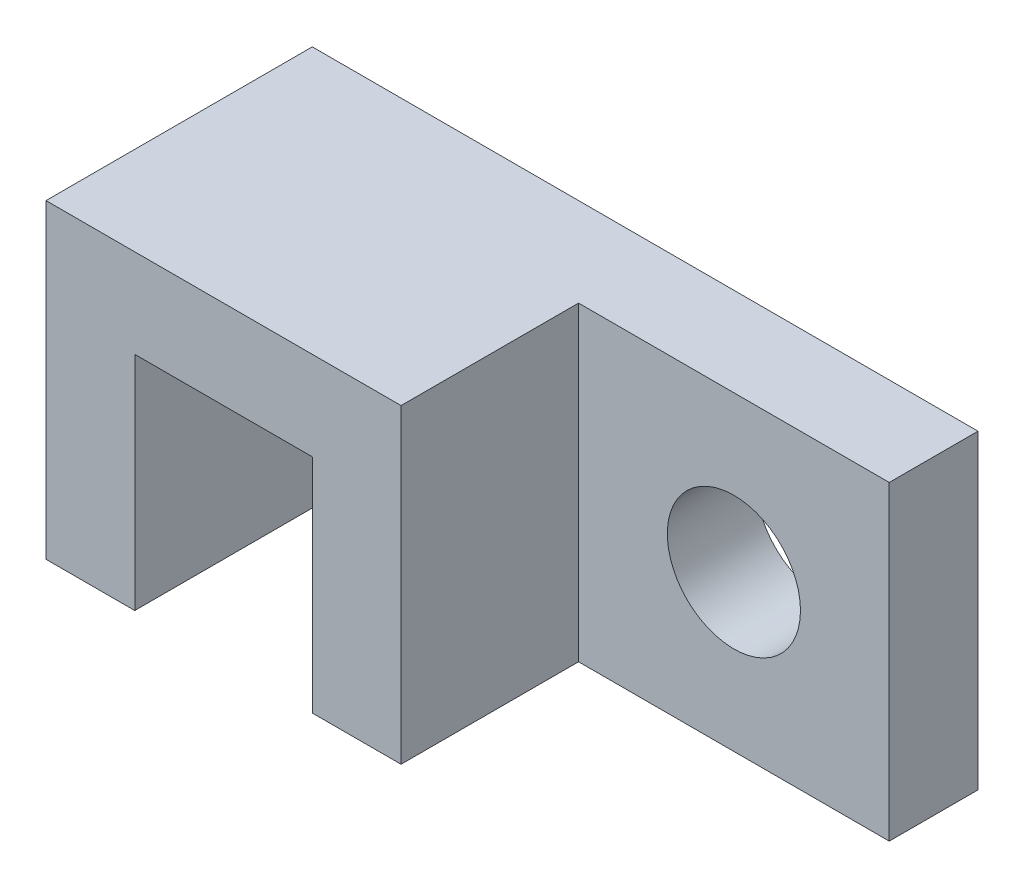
from build123d import *

# Parameters (mm, degrees)
BOSS_EXTRUDE1_DEPTH = 30
SKETCH1_3_W         = 35
SKETCH1_3_H         = 35
SKETCH1_3_R         = 7.5
BOSS_EXTRUDE2_DEPTH = 10


with BuildPart() as part:
    # Sketch1 → Boss-Extrude1 (new body)
    with BuildSketch(Plane.XY):
        Polygon((10, 0), (10, 25), (30, 25), (30, 0), (40, 0), (40, 35), (0, 35), (0, 0), align=None)
    extrude(amount=BOSS_EXTRUDE1_DEPTH)

    # Sketch1_3 → Boss-Extrude2 (add)
    # profile 1 of 2: a face of its own
    with BuildSketch(Plane.XY):
        Polygon((0, 0), (10, 0), (10, 25), (30, 25), (30, 0), (40, 0), (40, 35), (0, 35), align=None)
    # profile 2 of 2: a face of its own
    with BuildSketch(Plane.XY):
        with Locations((57.5, 17.5)):
            Rectangle(SKETCH1_3_W, SKETCH1_3_H)
        with Locations((57.5, 17.5)):
            Circle(SKETCH1_3_R, mode=Mode.SUBTRACT)
    extrude(amount=BOSS_EXTRUDE2_DEPTH)


solid = part.part
